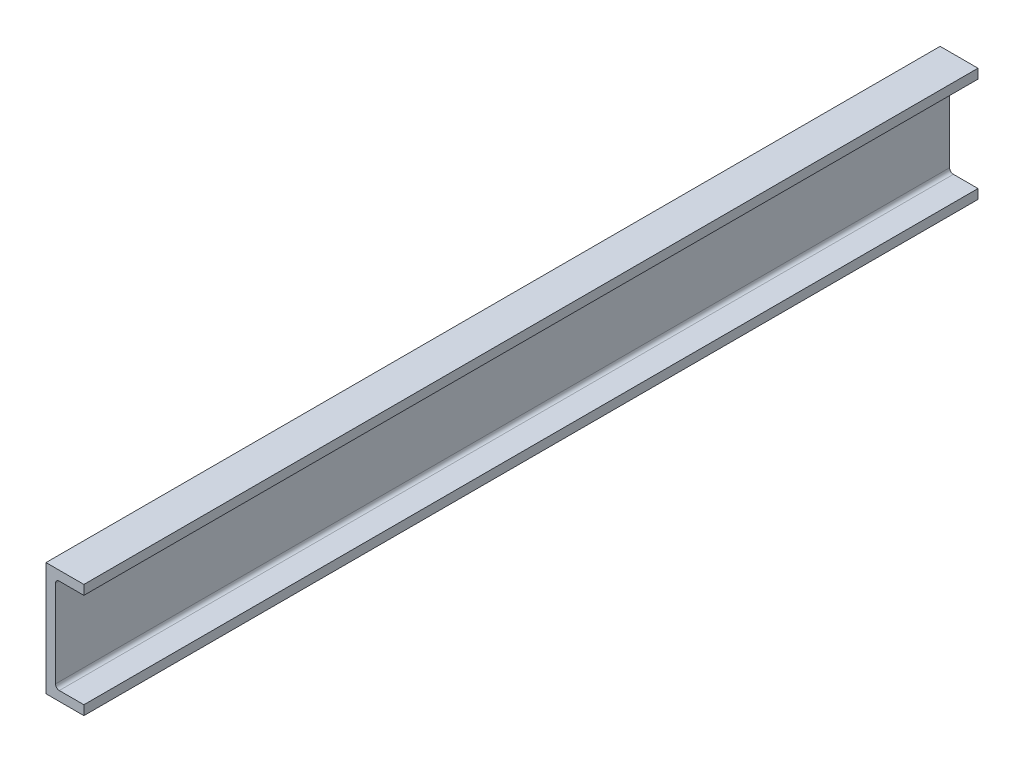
from build123d import *

# Parameters (mm, degrees)
BOSS_EXTRUDE1_DEPTH = 599.44
FILLET1_R           = 2.54


with BuildPart() as part:
    # Sketch1 → Boss-Extrude1 (new body)
    with BuildSketch(Plane.XY):
        Polygon((0, 0), (0, 76.2), (25.4, 76.2), (25.4, 69.85), (6.35, 69.85), (6.35, 6.35), (25.4, 6.35), (25.4, 0), align=None)
    extrude(amount=-BOSS_EXTRUDE1_DEPTH)

    # Fillet1
    fillet1_edges = [part.edges().sort_by_distance(p)[0] for p in [
        (6.35, 69.85, -299.72),
        (6.35, 6.35, -299.72),
    ]]
    fillet(fillet1_edges, radius=FILLET1_R)


solid = part.part
